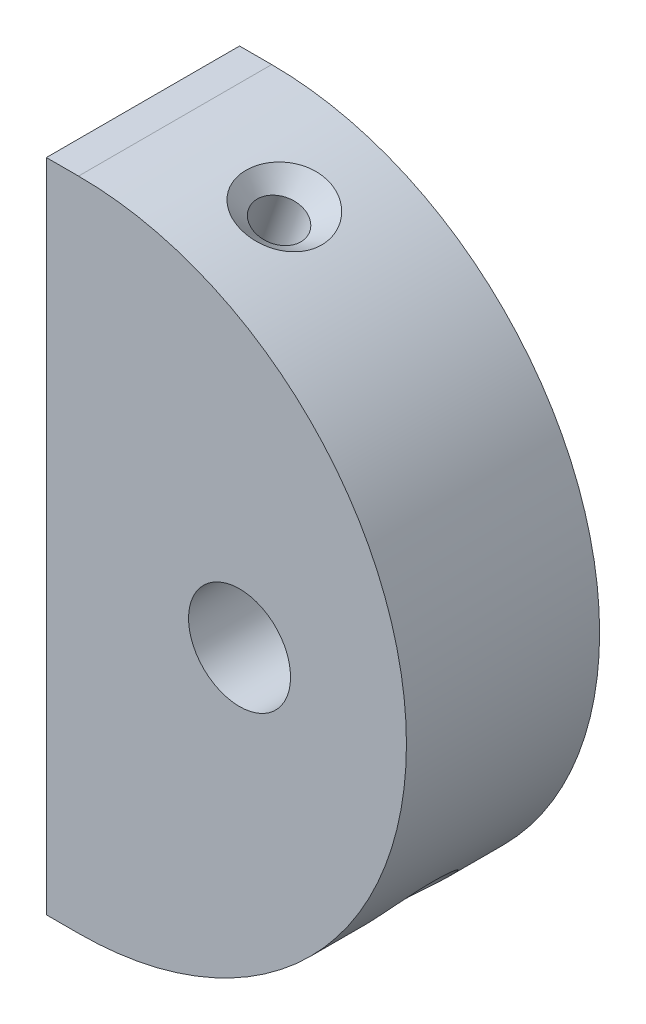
ISO-10303-21;
HEADER;
FILE_DESCRIPTION(('STEP AP214'),'2;1');
FILE_NAME('part.step','',(''),(''),'','','');
FILE_SCHEMA(('AUTOMOTIVE_DESIGN { 1 0 10303 214 1 1 1 1 }'));
ENDSEC;
DATA;
#1=APPLICATION_CONTEXT('core data for automotive mechanical design processes');
#2=APPLICATION_PROTOCOL_DEFINITION('international standard','automotive_design',2000,#1);
#3=PRODUCT_CONTEXT('',#1,'mechanical');
#4=PRODUCT('Part','Part','',(#3));
#5=PRODUCT_RELATED_PRODUCT_CATEGORY('part','',(#4));
#6=PRODUCT_DEFINITION_FORMATION('','',#4);
#7=PRODUCT_DEFINITION_CONTEXT('part definition',#1,'design');
#8=PRODUCT_DEFINITION('design','',#6,#7);
#9=PRODUCT_DEFINITION_SHAPE('','',#8);
#10=(LENGTH_UNIT() NAMED_UNIT(*) SI_UNIT(.MILLI.,.METRE.));
#11=(NAMED_UNIT(*) PLANE_ANGLE_UNIT() SI_UNIT($,.RADIAN.));
#12=(NAMED_UNIT(*) SI_UNIT($,.STERADIAN.) SOLID_ANGLE_UNIT());
#13=UNCERTAINTY_MEASURE_WITH_UNIT(LENGTH_MEASURE(1.E-05),#10,'distance_accuracy_value','');
#14=(GEOMETRIC_REPRESENTATION_CONTEXT(3) GLOBAL_UNCERTAINTY_ASSIGNED_CONTEXT((#13)) GLOBAL_UNIT_ASSIGNED_CONTEXT((#10,
#11,#12)) REPRESENTATION_CONTEXT('',''));
#15=CARTESIAN_POINT('',(0.,0.,0.));
#16=DIRECTION('',(0.,0.,1.));
#17=DIRECTION('',(1.,0.,0.));
#18=AXIS2_PLACEMENT_3D('',#15,#16,#17);
#19=CARTESIAN_POINT('',(2.64161251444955,0.,7.9375));
#20=DIRECTION('',(0.,0.,-1.));
#21=DIRECTION('',(-1.,0.,0.));
#22=AXIS2_PLACEMENT_3D('',#19,#20,#21);
#23=PLANE('',#22);
#24=CARTESIAN_POINT('',(2.64161251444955,0.,7.9375));
#25=DIRECTION('',(0.,0.,-1.));
#26=DIRECTION('',(-1.,0.,0.));
#27=AXIS2_PLACEMENT_3D('',#24,#25,#26);
#28=CIRCLE('',#27,26.9493874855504);
#29=CARTESIAN_POINT('',(2.64161251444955,26.9493874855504,7.9375));
#30=VERTEX_POINT('',#29);
#31=CARTESIAN_POINT('',(2.64161251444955,-26.9493874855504,7.9375));
#32=VERTEX_POINT('',#31);
#33=EDGE_CURVE('E124',#30,#32,#28,.T.);
#34=ORIENTED_EDGE('',*,*,#33,.F.);
#35=DIRECTION('',(1.,0.,0.));
#36=VECTOR('',#35,1.);
#37=CARTESIAN_POINT('',(0.,26.9493874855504,7.9375));
#38=LINE('',#37,#36);
#39=CARTESIAN_POINT('',(0.,26.9493874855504,7.9375));
#40=VERTEX_POINT('',#39);
#41=EDGE_CURVE('E131',#40,#30,#38,.T.);
#42=ORIENTED_EDGE('',*,*,#41,.F.);
#43=DIRECTION('',(0.,-1.,0.));
#44=VECTOR('',#43,1.);
#45=CARTESIAN_POINT('',(0.,26.9493874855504,7.9375));
#46=LINE('',#45,#44);
#47=CARTESIAN_POINT('',(0.,-26.9493874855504,7.9375));
#48=VERTEX_POINT('',#47);
#49=EDGE_CURVE('E129',#40,#48,#46,.T.);
#50=ORIENTED_EDGE('',*,*,#49,.T.);
#51=DIRECTION('',(1.,0.,0.));
#52=VECTOR('',#51,1.);
#53=CARTESIAN_POINT('',(0.,-26.9493874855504,7.9375));
#54=LINE('',#53,#52);
#55=EDGE_CURVE('E127',#48,#32,#54,.T.);
#56=ORIENTED_EDGE('',*,*,#55,.T.);
#57=EDGE_LOOP('',(#34,#42,#50,#56));
#58=FACE_BOUND('',#57,.T.);
#59=CARTESIAN_POINT('',(15.875,0.,7.9375));
#60=DIRECTION('',(0.,0.,1.));
#61=DIRECTION('',(1.,0.,0.));
#62=AXIS2_PLACEMENT_3D('',#59,#60,#61);
#63=CIRCLE('',#62,4.191);
#64=CARTESIAN_POINT('',(20.066,0.,7.9375));
#65=VERTEX_POINT('',#64);
#66=EDGE_CURVE('E110',#65,#65,#63,.T.);
#67=ORIENTED_EDGE('',*,*,#66,.F.);
#68=EDGE_LOOP('',(#67));
#69=FACE_BOUND('',#68,.T.);
#70=ADVANCED_FACE('F28',(#58,#69),#23,.F.);
#71=CARTESIAN_POINT('',(2.64161251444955,0.,-7.9375));
#72=DIRECTION('',(0.,0.,-1.));
#73=DIRECTION('',(-1.,0.,0.));
#74=AXIS2_PLACEMENT_3D('',#71,#72,#73);
#75=PLANE('',#74);
#76=CARTESIAN_POINT('',(2.64161251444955,0.,-7.9375));
#77=DIRECTION('',(0.,0.,-1.));
#78=DIRECTION('',(-1.,0.,0.));
#79=AXIS2_PLACEMENT_3D('',#76,#77,#78);
#80=CIRCLE('',#79,26.9493874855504);
#81=CARTESIAN_POINT('',(2.64161251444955,26.9493874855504,-7.9375));
#82=VERTEX_POINT('',#81);
#83=CARTESIAN_POINT('',(2.64161251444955,-26.9493874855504,-7.9375));
#84=VERTEX_POINT('',#83);
#85=EDGE_CURVE('E113',#82,#84,#80,.T.);
#86=ORIENTED_EDGE('',*,*,#85,.T.);
#87=DIRECTION('',(1.,0.,0.));
#88=VECTOR('',#87,1.);
#89=CARTESIAN_POINT('',(0.,-26.9493874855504,-7.9375));
#90=LINE('',#89,#88);
#91=CARTESIAN_POINT('',(0.,-26.9493874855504,-7.9375));
#92=VERTEX_POINT('',#91);
#93=EDGE_CURVE('E116',#92,#84,#90,.T.);
#94=ORIENTED_EDGE('',*,*,#93,.F.);
#95=DIRECTION('',(0.,-1.,0.));
#96=VECTOR('',#95,1.);
#97=CARTESIAN_POINT('',(0.,26.9493874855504,-7.9375));
#98=LINE('',#97,#96);
#99=CARTESIAN_POINT('',(0.,26.9493874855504,-7.9375));
#100=VERTEX_POINT('',#99);
#101=EDGE_CURVE('E119',#100,#92,#98,.T.);
#102=ORIENTED_EDGE('',*,*,#101,.F.);
#103=DIRECTION('',(1.,0.,0.));
#104=VECTOR('',#103,1.);
#105=CARTESIAN_POINT('',(0.,26.9493874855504,-7.9375));
#106=LINE('',#105,#104);
#107=EDGE_CURVE('E121',#100,#82,#106,.T.);
#108=ORIENTED_EDGE('',*,*,#107,.T.);
#109=EDGE_LOOP('',(#86,#94,#102,#108));
#110=FACE_BOUND('',#109,.T.);
#111=CARTESIAN_POINT('',(15.875,0.,-7.9375));
#112=DIRECTION('',(0.,0.,1.));
#113=DIRECTION('',(1.,0.,0.));
#114=AXIS2_PLACEMENT_3D('',#111,#112,#113);
#115=CIRCLE('',#114,4.191);
#116=CARTESIAN_POINT('',(20.066,0.,-7.9375));
#117=VERTEX_POINT('',#116);
#118=EDGE_CURVE('E107',#117,#117,#115,.T.);
#119=ORIENTED_EDGE('',*,*,#118,.T.);
#120=EDGE_LOOP('',(#119));
#121=FACE_BOUND('',#120,.T.);
#122=ADVANCED_FACE('F158',(#110,#121),#75,.T.);
#123=CARTESIAN_POINT('',(2.64161251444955,0.,7.9375));
#124=DIRECTION('',(0.,0.,-1.));
#125=DIRECTION('',(-1.,0.,0.));
#126=AXIS2_PLACEMENT_3D('',#123,#124,#125);
#127=CYLINDRICAL_SURFACE('',#126,26.9493874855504);
#128=CARTESIAN_POINT('',(9.7979718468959,25.9818399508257,-2.86663322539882));
#129=CARTESIAN_POINT('',(9.67203500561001,26.016527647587,-2.76504370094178));
#130=CARTESIAN_POINT('',(9.55308158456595,26.0483043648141,-2.65373042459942));
#131=CARTESIAN_POINT('',(9.33139317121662,26.1061196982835,-2.41456822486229));
#132=CARTESIAN_POINT('',(9.22867501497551,26.1321523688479,-2.28670238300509));
#133=CARTESIAN_POINT('',(9.02563814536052,26.1825595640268,-1.99493173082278));
#134=CARTESIAN_POINT('',(8.92857905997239,26.2059327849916,-1.82857341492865));
#135=CARTESIAN_POINT('',(8.76114552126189,26.2455372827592,-1.48214829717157));
#136=CARTESIAN_POINT('',(8.69078128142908,26.2617658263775,-1.30207628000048));
#137=CARTESIAN_POINT('',(8.5750079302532,26.2881734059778,-0.922513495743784));
#138=CARTESIAN_POINT('',(8.5312186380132,26.2979623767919,-0.722500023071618));
#139=CARTESIAN_POINT('',(8.47596753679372,26.310275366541,-0.31783850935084));
#140=CARTESIAN_POINT('',(8.46451065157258,26.3127982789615,-0.113189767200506));
#141=CARTESIAN_POINT('',(8.47432643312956,26.3106247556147,0.301459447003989));
#142=CARTESIAN_POINT('',(8.49659195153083,26.3057093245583,0.51143615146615));
#143=CARTESIAN_POINT('',(8.57519688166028,26.2880898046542,0.924607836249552));
#144=CARTESIAN_POINT('',(8.63153952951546,26.2753849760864,1.1278021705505));
#145=CARTESIAN_POINT('',(8.77689096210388,26.2418249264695,1.52115763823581));
#146=CARTESIAN_POINT('',(8.8658553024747,26.2209807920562,1.7113360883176));
#147=CARTESIAN_POINT('',(9.07431847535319,26.1706176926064,2.07293901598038));
#148=CARTESIAN_POINT('',(9.19381399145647,26.1410996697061,2.24436552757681));
#149=CARTESIAN_POINT('',(9.45552466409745,26.0740798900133,2.55680528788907));
#150=CARTESIAN_POINT('',(9.59679811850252,26.036893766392,2.69867308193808));
#151=CARTESIAN_POINT('',(9.90095926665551,25.9537305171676,2.953818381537));
#152=CARTESIAN_POINT('',(10.0638369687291,25.9077574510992,3.06710903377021));
#153=CARTESIAN_POINT('',(10.3945796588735,25.8106304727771,3.25360802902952));
#154=CARTESIAN_POINT('',(10.5613782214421,25.7600305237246,3.32899436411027));
#155=CARTESIAN_POINT('',(10.9041088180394,25.6521503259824,3.44714631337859));
#156=CARTESIAN_POINT('',(11.0800360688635,25.5948735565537,3.48992883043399));
#157=CARTESIAN_POINT('',(11.4228611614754,25.479200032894,3.53907248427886));
#158=CARTESIAN_POINT('',(11.5895494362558,25.4211502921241,3.5477329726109));
#159=CARTESIAN_POINT('',(11.9206628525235,25.302166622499,3.53461951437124));
#160=CARTESIAN_POINT('',(12.0850884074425,25.2412332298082,3.51285120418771));
#161=CARTESIAN_POINT('',(12.4027039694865,25.1200867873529,3.44079885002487));
#162=CARTESIAN_POINT('',(12.5560746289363,25.0598959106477,3.39126742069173));
#163=CARTESIAN_POINT('',(12.8522765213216,24.9406765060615,3.2662029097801));
#164=CARTESIAN_POINT('',(12.9951066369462,24.8816481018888,3.19066707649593));
#165=CARTESIAN_POINT('',(13.2713653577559,24.7649158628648,3.01352664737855));
#166=CARTESIAN_POINT('',(13.4043576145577,24.7073119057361,2.9111776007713));
#167=CARTESIAN_POINT('',(13.6532016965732,24.5974171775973,2.68506450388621));
#168=CARTESIAN_POINT('',(13.7690488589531,24.5451278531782,2.56129464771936));
#169=CARTESIAN_POINT('',(13.9887464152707,24.4443781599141,2.2871323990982));
#170=CARTESIAN_POINT('',(14.0912954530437,24.3964002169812,2.13552020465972));
#171=CARTESIAN_POINT('',(14.2731504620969,24.3102234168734,1.8164192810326));
#172=CARTESIAN_POINT('',(14.3524493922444,24.2720275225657,1.64892576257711));
#173=CARTESIAN_POINT('',(14.4911229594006,24.2046473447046,1.29103160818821));
#174=CARTESIAN_POINT('',(14.5488499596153,24.1762182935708,1.09984907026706));
#175=CARTESIAN_POINT('',(14.6358575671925,24.1331708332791,0.709614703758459));
#176=CARTESIAN_POINT('',(14.6651317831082,24.1185555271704,0.510561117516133));
#177=CARTESIAN_POINT('',(14.6954264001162,24.1034308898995,0.101722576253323));
#178=CARTESIAN_POINT('',(14.6952671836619,24.1035104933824,-0.108172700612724));
#179=CARTESIAN_POINT('',(14.6637304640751,24.1192550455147,-0.525034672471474));
#180=CARTESIAN_POINT('',(14.6323492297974,24.1349218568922,-0.732001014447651));
#181=CARTESIAN_POINT('',(14.5384059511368,24.1813678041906,-1.13892373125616));
#182=CARTESIAN_POINT('',(14.4755749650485,24.2122772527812,-1.33880343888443));
#183=CARTESIAN_POINT('',(14.3195610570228,24.2879081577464,-1.72359322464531));
#184=CARTESIAN_POINT('',(14.2263787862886,24.3326293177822,-1.90850362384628));
#185=CARTESIAN_POINT('',(14.0138200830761,24.4326791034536,-2.25311270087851));
#186=CARTESIAN_POINT('',(13.8951136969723,24.4877324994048,-2.4133033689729));
#187=CARTESIAN_POINT('',(13.6326128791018,24.6066673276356,-2.70781212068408));
#188=CARTESIAN_POINT('',(13.4888271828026,24.6705456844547,-2.84213917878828));
#189=CARTESIAN_POINT('',(13.1886510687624,24.8002939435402,-3.07242040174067));
#190=CARTESIAN_POINT('',(13.0334851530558,24.8658303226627,-3.17015586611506));
#191=CARTESIAN_POINT('',(12.7080406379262,24.9993466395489,-3.33351148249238));
#192=CARTESIAN_POINT('',(12.5377709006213,25.0673251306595,-3.3991503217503));
#193=CARTESIAN_POINT('',(12.2002642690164,25.1978565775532,-3.49164757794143));
#194=CARTESIAN_POINT('',(12.0337202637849,25.2604419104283,-3.52099640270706));
#195=CARTESIAN_POINT('',(11.6971409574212,25.3830439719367,-3.54810683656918));
#196=CARTESIAN_POINT('',(11.5271062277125,25.4430611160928,-3.54587357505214));
#197=CARTESIAN_POINT('',(11.1962227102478,25.5561621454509,-3.51072320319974));
#198=CARTESIAN_POINT('',(11.0352940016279,25.6094334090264,-3.47913347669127));
#199=CARTESIAN_POINT('',(10.7197482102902,25.710710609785,-3.38847000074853));
#200=CARTESIAN_POINT('',(10.5651271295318,25.7587199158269,-3.32941396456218));
#201=CARTESIAN_POINT('',(10.306302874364,25.8367013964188,-3.20534009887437));
#202=CARTESIAN_POINT('',(10.1996747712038,25.8680636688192,-3.14614026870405));
#203=CARTESIAN_POINT('',(9.99334619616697,25.9274566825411,-3.01537309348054));
#204=CARTESIAN_POINT('',(9.89364389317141,25.9554883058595,-2.94380903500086));
#205=CARTESIAN_POINT('',(9.7979718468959,25.9818399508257,-2.86663322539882));
#206=B_SPLINE_CURVE_WITH_KNOTS('',3,(#128,#129,#130,#131,#132,#133,#134,#135,#136,#137,#138,
#139,#140,#141,#142,#143,#144,#145,#146,#147,#148,#149,#150,#151,#152,#153,#154,#155,#156,#157,
#158,#159,#160,#161,#162,#163,#164,#165,#166,#167,#168,#169,#170,#171,#172,#173,#174,#175,#176,
#177,#178,#179,#180,#181,#182,#183,#184,#185,#186,#187,#188,#189,#190,#191,#192,#193,#194,#195,
#196,#197,#198,#199,#200,#201,#202,#203,#204,#205),.UNSPECIFIED.,.T.,.F.,(4,2,2,2,2,2,2,2,2,2,2,
2,2,2,2,2,2,2,2,2,2,2,2,2,2,2,2,2,2,2,2,2,2,2,2,2,2,2,4),(0.,0.496088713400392,
0.992688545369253,1.57214224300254,2.15181741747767,2.76398387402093,3.37624354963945,
4.00688299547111,4.63758233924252,5.26742558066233,5.89720043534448,6.50493048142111,
7.11238043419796,7.67910588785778,8.24553733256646,8.77307120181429,9.30050736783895,
9.81429263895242,10.3281322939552,10.8581153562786,11.3882422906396,11.9534534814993,
12.5188356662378,13.1212948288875,13.7238892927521,14.3506392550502,14.9774641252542,
15.6097432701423,16.2420088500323,16.8593536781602,17.4764839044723,18.0576157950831,
18.6384089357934,19.1766205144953,19.7147446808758,20.2296624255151,20.7442485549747,
21.1212186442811,21.4980886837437),.UNSPECIFIED.);
#207=CARTESIAN_POINT('',(11.6476930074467,25.4,3.5433));
#208=VERTEX_POINT('',#207);
#209=CARTESIAN_POINT('',(11.6476930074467,25.4,-3.5433));
#210=VERTEX_POINT('',#209);
#211=EDGE_CURVE('E11',#208,#210,#206,.T.);
#212=ORIENTED_EDGE('',*,*,#211,.F.);
#213=EDGE_CURVE('E33',#210,#208,#206,.T.);
#214=ORIENTED_EDGE('',*,*,#213,.F.);
#215=EDGE_LOOP('',(#212,#214));
#216=FACE_BOUND('',#215,.T.);
#217=CARTESIAN_POINT('',(20.1425282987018,-20.4935949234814,-2.70960994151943));
#218=CARTESIAN_POINT('',(20.2356817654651,-20.4140439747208,-2.81999497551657));
#219=CARTESIAN_POINT('',(20.3344098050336,-20.3286325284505,-2.92146354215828));
#220=CARTESIAN_POINT('',(20.5408104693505,-20.1471357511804,-3.10379113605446));
#221=CARTESIAN_POINT('',(20.6484856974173,-20.0510473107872,-3.18464413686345));
#222=CARTESIAN_POINT('',(20.8837178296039,-19.8374199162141,-3.33162138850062));
#223=CARTESIAN_POINT('',(21.0120966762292,-19.7186944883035,-3.39474002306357));
#224=CARTESIAN_POINT('',(21.2725338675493,-19.4728088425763,-3.48889539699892));
#225=CARTESIAN_POINT('',(21.4045920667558,-19.3456489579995,-3.51993340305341));
#226=CARTESIAN_POINT('',(21.6603273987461,-19.0941951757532,-3.54764166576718));
#227=CARTESIAN_POINT('',(21.7840523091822,-18.9701526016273,-3.54617412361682));
#228=CARTESIAN_POINT('',(22.0270949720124,-18.7217185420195,-3.51349194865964));
#229=CARTESIAN_POINT('',(22.146413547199,-18.5973271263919,-3.48228289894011));
#230=CARTESIAN_POINT('',(22.3755940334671,-18.3539366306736,-3.39219230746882));
#231=CARTESIAN_POINT('',(22.4855769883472,-18.234883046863,-3.33376295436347));
#232=CARTESIAN_POINT('',(22.6957795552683,-18.0034536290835,-3.19164558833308));
#233=CARTESIAN_POINT('',(22.7959976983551,-17.8910788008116,-3.1079537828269));
#234=CARTESIAN_POINT('',(22.988604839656,-17.6717725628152,-2.91443295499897));
#235=CARTESIAN_POINT('',(23.0805308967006,-17.5652290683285,-2.80370541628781));
#236=CARTESIAN_POINT('',(23.2505807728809,-17.3654014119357,-2.56163575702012));
#237=CARTESIAN_POINT('',(23.3287006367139,-17.2721210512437,-2.43028774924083));
#238=CARTESIAN_POINT('',(23.4751484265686,-17.0952440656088,-2.14110062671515));
#239=CARTESIAN_POINT('',(23.5424396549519,-17.0127478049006,-1.98206344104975));
#240=CARTESIAN_POINT('',(23.6597107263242,-16.8676542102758,-1.64922344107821));
#241=CARTESIAN_POINT('',(23.7096854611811,-16.8050627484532,-1.47541628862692));
#242=CARTESIAN_POINT('',(23.7945713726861,-16.6981078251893,-1.10630293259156));
#243=CARTESIAN_POINT('',(23.8283441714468,-16.6551301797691,-0.910331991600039));
#244=CARTESIAN_POINT('',(23.8757723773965,-16.5946202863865,-0.512121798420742));
#245=CARTESIAN_POINT('',(23.889423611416,-16.577093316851,-0.30988125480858));
#246=CARTESIAN_POINT('',(23.8966579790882,-16.5678177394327,0.102651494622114));
#247=CARTESIAN_POINT('',(23.8895229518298,-16.5769916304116,0.312978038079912));
#248=CARTESIAN_POINT('',(23.8536532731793,-16.6228651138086,0.728757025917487));
#249=CARTESIAN_POINT('',(23.8249163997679,-16.6595675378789,0.934208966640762));
#250=CARTESIAN_POINT('',(23.7458605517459,-16.7596020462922,1.3350419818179));
#251=CARTESIAN_POINT('',(23.695463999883,-16.8230298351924,1.53038400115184));
#252=CARTESIAN_POINT('',(23.5734344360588,-16.9746205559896,1.90415797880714));
#253=CARTESIAN_POINT('',(23.5018027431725,-17.0627819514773,2.08259098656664));
#254=CARTESIAN_POINT('',(23.340444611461,-17.2581391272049,2.41152780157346));
#255=CARTESIAN_POINT('',(23.2513107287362,-17.3647005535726,2.56269744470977));
#256=CARTESIAN_POINT('',(23.0549669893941,-17.5950919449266,2.8377135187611));
#257=CARTESIAN_POINT('',(22.9477645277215,-17.7189148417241,2.96157108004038));
#258=CARTESIAN_POINT('',(22.7246984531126,-17.971245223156,3.16985094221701));
#259=CARTESIAN_POINT('',(22.6098080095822,-18.0989642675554,3.25626825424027));
#260=CARTESIAN_POINT('',(22.3687516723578,-18.3614025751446,3.39663898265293));
#261=CARTESIAN_POINT('',(22.2425919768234,-18.496117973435,3.45061011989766));
#262=CARTESIAN_POINT('',(21.9920277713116,-18.7579686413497,3.52088130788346));
#263=CARTESIAN_POINT('',(21.8681440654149,-18.884956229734,3.53960138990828));
#264=CARTESIAN_POINT('',(21.6174793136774,-19.1368099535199,3.54600221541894));
#265=CARTESIAN_POINT('',(21.4906989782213,-19.2616765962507,3.53369049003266));
#266=CARTESIAN_POINT('',(21.2426013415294,-19.5013191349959,3.47956447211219));
#267=CARTESIAN_POINT('',(21.1212474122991,-19.6162949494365,3.43879132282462));
#268=CARTESIAN_POINT('',(20.8830446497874,-19.8379973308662,3.33051995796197));
#269=CARTESIAN_POINT('',(20.766196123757,-19.9447233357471,3.26301992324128));
#270=CARTESIAN_POINT('',(20.5376479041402,-20.1500763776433,3.10193278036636));
#271=CARTESIAN_POINT('',(20.4261295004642,-20.2484593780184,3.00777907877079));
#272=CARTESIAN_POINT('',(20.214211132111,-20.432645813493,2.79730376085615));
#273=CARTESIAN_POINT('',(20.1138139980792,-20.5184460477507,2.68097652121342));
#274=CARTESIAN_POINT('',(19.9207366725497,-20.6813521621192,2.42168844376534));
#275=CARTESIAN_POINT('',(19.8289411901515,-20.7575696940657,2.27751135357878));
#276=CARTESIAN_POINT('',(19.6631200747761,-20.8937624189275,1.97226941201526));
#277=CARTESIAN_POINT('',(19.5890999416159,-20.9537325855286,1.81119935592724));
#278=CARTESIAN_POINT('',(19.4562957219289,-21.0604770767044,1.46502101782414));
#279=CARTESIAN_POINT('',(19.3988858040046,-21.1060802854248,1.27902327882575));
#280=CARTESIAN_POINT('',(19.3079716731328,-21.1779443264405,0.897686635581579));
#281=CARTESIAN_POINT('',(19.2744726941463,-21.2042009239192,0.702345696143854));
#282=CARTESIAN_POINT('',(19.2313333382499,-21.2379721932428,0.298492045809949));
#283=CARTESIAN_POINT('',(19.2228316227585,-21.2445925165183,0.0897817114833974));
#284=CARTESIAN_POINT('',(19.2331719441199,-21.236517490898,-0.326593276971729));
#285=CARTESIAN_POINT('',(19.2520211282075,-21.2218165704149,-0.534257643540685));
#286=CARTESIAN_POINT('',(19.3169735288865,-21.1708182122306,-0.945573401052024));
#287=CARTESIAN_POINT('',(19.3634511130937,-21.1342240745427,-1.14912918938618));
#288=CARTESIAN_POINT('',(19.4825727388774,-21.0394226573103,-1.54308839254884));
#289=CARTESIAN_POINT('',(19.5552018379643,-20.981227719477,-1.7334992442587));
#290=CARTESIAN_POINT('',(19.7087926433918,-20.8563830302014,-2.0618846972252));
#291=CARTESIAN_POINT('',(19.7857851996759,-20.7932396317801,-2.20307251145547));
#292=CARTESIAN_POINT('',(19.9540064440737,-20.6533882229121,-2.46927967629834));
#293=CARTESIAN_POINT('',(20.0452262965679,-20.5766886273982,-2.59430897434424));
#294=CARTESIAN_POINT('',(20.1425282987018,-20.4935949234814,-2.70960994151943));
#295=B_SPLINE_CURVE_WITH_KNOTS('',3,(#217,#218,#219,#220,#221,#222,#223,#224,#225,#226,#227,
#228,#229,#230,#231,#232,#233,#234,#235,#236,#237,#238,#239,#240,#241,#242,#243,#244,#245,#246,
#247,#248,#249,#250,#251,#252,#253,#254,#255,#256,#257,#258,#259,#260,#261,#262,#263,#264,#265,
#266,#267,#268,#269,#270,#271,#272,#273,#274,#275,#276,#277,#278,#279,#280,#281,#282,#283,#284,
#285,#286,#287,#288,#289,#290,#291,#292,#293,#294),.UNSPECIFIED.,.T.,.F.,(4,2,2,2,2,2,2,2,2,2,2,
2,2,2,2,2,2,2,2,2,2,2,2,2,2,2,2,2,2,2,2,2,2,2,2,2,2,2,4),(0.,0.494223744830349,
0.988591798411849,1.54334866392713,2.09808362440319,2.62112523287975,3.14406867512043,
3.65861877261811,4.17324615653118,4.70811378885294,5.24313440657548,5.81478806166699,
6.38661020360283,6.99421661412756,7.60194902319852,8.2309247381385,8.85996515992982,
9.49127760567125,10.1225508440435,10.7353027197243,11.3478044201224,11.9216624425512,
12.4952067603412,13.0276954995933,13.5600550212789,14.0738964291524,14.5877728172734,
15.1135197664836,15.6394002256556,16.1984128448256,16.7575982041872,17.3547163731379,
17.9519652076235,18.5760277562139,19.2002534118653,19.833136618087,20.4656587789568,
20.9822120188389,21.4984457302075),.UNSPECIFIED.);
#296=CARTESIAN_POINT('',(21.7037998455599,-19.05,-3.5433));
#297=VERTEX_POINT('',#296);
#298=CARTESIAN_POINT('',(21.7037998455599,-19.05,3.5433));
#299=VERTEX_POINT('',#298);
#300=EDGE_CURVE('E51',#297,#299,#295,.T.);
#301=ORIENTED_EDGE('',*,*,#300,.F.);
#302=EDGE_CURVE('E137',#299,#297,#295,.T.);
#303=ORIENTED_EDGE('',*,*,#302,.F.);
#304=EDGE_LOOP('',(#301,#303));
#305=FACE_BOUND('',#304,.T.);
#306=ORIENTED_EDGE('',*,*,#85,.F.);
#307=DIRECTION('',(0.,0.,-1.));
#308=VECTOR('',#307,1.);
#309=CARTESIAN_POINT('',(2.64161251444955,26.9493874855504,7.9375));
#310=LINE('',#309,#308);
#311=EDGE_CURVE('E135',#30,#82,#310,.T.);
#312=ORIENTED_EDGE('',*,*,#311,.F.);
#313=ORIENTED_EDGE('',*,*,#33,.T.);
#314=DIRECTION('',(0.,0.,-1.));
#315=VECTOR('',#314,1.);
#316=CARTESIAN_POINT('',(2.64161251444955,-26.9493874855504,7.9375));
#317=LINE('',#316,#315);
#318=EDGE_CURVE('E134',#32,#84,#317,.T.);
#319=ORIENTED_EDGE('',*,*,#318,.T.);
#320=EDGE_LOOP('',(#306,#312,#313,#319));
#321=FACE_BOUND('',#320,.T.);
#322=ADVANCED_FACE('F30',(#216,#305,#321),#127,.T.);
#323=CARTESIAN_POINT('',(0.,26.9493874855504,7.9375));
#324=DIRECTION('',(0.,1.,0.));
#325=DIRECTION('',(0.,0.,1.));
#326=AXIS2_PLACEMENT_3D('',#323,#324,#325);
#327=PLANE('',#326);
#328=ORIENTED_EDGE('',*,*,#107,.F.);
#329=DIRECTION('',(0.,0.,-1.));
#330=VECTOR('',#329,1.);
#331=CARTESIAN_POINT('',(0.,26.9493874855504,7.9375));
#332=LINE('',#331,#330);
#333=EDGE_CURVE('E138',#40,#100,#332,.T.);
#334=ORIENTED_EDGE('',*,*,#333,.F.);
#335=ORIENTED_EDGE('',*,*,#41,.T.);
#336=ORIENTED_EDGE('',*,*,#311,.T.);
#337=EDGE_LOOP('',(#328,#334,#335,#336));
#338=FACE_BOUND('',#337,.T.);
#339=ADVANCED_FACE('F165',(#338),#327,.T.);
#340=CARTESIAN_POINT('',(0.,26.9493874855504,7.9375));
#341=DIRECTION('',(1.,0.,0.));
#342=DIRECTION('',(0.,0.,-1.));
#343=AXIS2_PLACEMENT_3D('',#340,#341,#342);
#344=PLANE('',#343);
#345=ORIENTED_EDGE('',*,*,#101,.T.);
#346=DIRECTION('',(0.,0.,-1.));
#347=VECTOR('',#346,1.);
#348=CARTESIAN_POINT('',(0.,-26.9493874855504,7.9375));
#349=LINE('',#348,#347);
#350=EDGE_CURVE('E140',#48,#92,#349,.T.);
#351=ORIENTED_EDGE('',*,*,#350,.F.);
#352=ORIENTED_EDGE('',*,*,#49,.F.);
#353=ORIENTED_EDGE('',*,*,#333,.T.);
#354=EDGE_LOOP('',(#345,#351,#352,#353));
#355=FACE_BOUND('',#354,.T.);
#356=ADVANCED_FACE('F168',(#355),#344,.F.);
#357=CARTESIAN_POINT('',(0.,-26.9493874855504,7.9375));
#358=DIRECTION('',(0.,1.,0.));
#359=DIRECTION('',(0.,0.,1.));
#360=AXIS2_PLACEMENT_3D('',#357,#358,#359);
#361=PLANE('',#360);
#362=ORIENTED_EDGE('',*,*,#93,.T.);
#363=ORIENTED_EDGE('',*,*,#318,.F.);
#364=ORIENTED_EDGE('',*,*,#55,.F.);
#365=ORIENTED_EDGE('',*,*,#350,.T.);
#366=EDGE_LOOP('',(#362,#363,#364,#365));
#367=FACE_BOUND('',#366,.T.);
#368=ADVANCED_FACE('F156',(#367),#361,.F.);
#369=CARTESIAN_POINT('',(15.875,0.,7.9375));
#370=DIRECTION('',(0.,0.,-1.));
#371=DIRECTION('',(-1.,0.,0.));
#372=AXIS2_PLACEMENT_3D('',#369,#370,#371);
#373=CYLINDRICAL_SURFACE('',#372,4.191);
#374=ORIENTED_EDGE('',*,*,#66,.T.);
#375=EDGE_LOOP('',(#374));
#376=FACE_BOUND('',#375,.T.);
#377=ORIENTED_EDGE('',*,*,#118,.F.);
#378=EDGE_LOOP('',(#377));
#379=FACE_BOUND('',#378,.T.);
#380=ADVANCED_FACE('F152',(#376,#379),#373,.F.);
#381=CARTESIAN_POINT('',(21.7037998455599,-19.05,0.));
#382=DIRECTION('',(0.707332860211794,-0.706880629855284,0.));
#383=DIRECTION('',(0.706880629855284,0.707332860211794,0.));
#384=AXIS2_PLACEMENT_3D('',#381,#382,#383);
#385=CONICAL_SURFACE('',#384,3.5433,0.872664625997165);
#386=ORIENTED_EDGE('',*,*,#300,.T.);
#387=ORIENTED_EDGE('',*,*,#302,.T.);
#388=EDGE_LOOP('',(#386,#387));
#389=FACE_BOUND('',#388,.T.);
#390=CARTESIAN_POINT('',(20.7276626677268,-18.0744869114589,0.));
#391=DIRECTION('',(0.707332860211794,-0.706880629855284,0.));
#392=DIRECTION('',(0.706880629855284,0.707332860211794,0.));
#393=AXIS2_PLACEMENT_3D('',#390,#391,#392);
#394=CIRCLE('',#393,1.89864999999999);
#395=CARTESIAN_POINT('',(22.0697815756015,-16.7315093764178,0.));
#396=VERTEX_POINT('',#395);
#397=EDGE_CURVE('E104',#396,#396,#394,.T.);
#398=ORIENTED_EDGE('',*,*,#397,.F.);
#399=EDGE_LOOP('',(#398));
#400=FACE_BOUND('',#399,.T.);
#401=ADVANCED_FACE('F146',(#389,#400),#385,.F.);
#402=CARTESIAN_POINT('',(21.7037998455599,-19.05,0.));
#403=DIRECTION('',(0.707332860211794,-0.706880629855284,0.));
#404=DIRECTION('',(0.706880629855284,0.707332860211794,0.));
#405=AXIS2_PLACEMENT_3D('',#402,#403,#404);
#406=CYLINDRICAL_SURFACE('',#405,1.89864999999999);
#407=CARTESIAN_POINT('',(12.7206725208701,-10.0726160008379,0.));
#408=DIRECTION('',(0.707332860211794,-0.706880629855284,0.));
#409=DIRECTION('',(0.706880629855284,0.707332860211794,0.));
#410=AXIS2_PLACEMENT_3D('',#407,#408,#409);
#411=CIRCLE('',#410,1.89864999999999);
#412=CARTESIAN_POINT('',(14.0627914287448,-8.72963846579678,0.));
#413=VERTEX_POINT('',#412);
#414=EDGE_CURVE('E99',#413,#413,#411,.T.);
#415=ORIENTED_EDGE('',*,*,#414,.F.);
#416=EDGE_LOOP('',(#415));
#417=FACE_BOUND('',#416,.T.);
#418=ORIENTED_EDGE('',*,*,#397,.T.);
#419=EDGE_LOOP('',(#418));
#420=FACE_BOUND('',#419,.T.);
#421=ADVANCED_FACE('F151',(#417,#420),#406,.F.);
#422=CARTESIAN_POINT('',(12.7206725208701,-10.0726160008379,0.));
#423=DIRECTION('',(0.707332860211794,-0.706880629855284,0.));
#424=DIRECTION('',(0.706880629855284,0.707332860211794,0.));
#425=AXIS2_PLACEMENT_3D('',#422,#423,#424);
#426=CONICAL_SURFACE('',#425,1.89864999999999,1.02974425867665);
#427=CARTESIAN_POINT('',(11.9137302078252,-9.2661896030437,0.));
#428=VERTEX_POINT('',#427);
#429=VERTEX_LOOP('',#428);
#430=FACE_BOUND('',#429,.T.);
#431=ORIENTED_EDGE('',*,*,#414,.T.);
#432=EDGE_LOOP('',(#431));
#433=FACE_BOUND('',#432,.T.);
#434=ADVANCED_FACE('F200',(#430,#433),#426,.F.);
#435=CARTESIAN_POINT('',(11.6476930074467,25.4,0.));
#436=DIRECTION('',(0.334184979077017,0.942507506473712,0.));
#437=DIRECTION('',(-0.942507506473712,0.334184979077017,0.));
#438=AXIS2_PLACEMENT_3D('',#435,#436,#437);
#439=CONICAL_SURFACE('',#438,3.5433,0.872664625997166);
#440=ORIENTED_EDGE('',*,*,#211,.T.);
#441=ORIENTED_EDGE('',*,*,#213,.T.);
#442=EDGE_LOOP('',(#440,#441));
#443=FACE_BOUND('',#442,.T.);
#444=CARTESIAN_POINT('',(11.1865093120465,24.0993158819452,0.));
#445=DIRECTION('',(0.334184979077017,0.942507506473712,0.));
#446=DIRECTION('',(-0.942507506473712,0.334184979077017,0.));
#447=AXIS2_PLACEMENT_3D('',#444,#445,#446);
#448=CIRCLE('',#447,1.89864999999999);
#449=CARTESIAN_POINT('',(9.39701743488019,24.7338161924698,0.));
#450=VERTEX_POINT('',#449);
#451=EDGE_CURVE('E96',#450,#450,#448,.T.);
#452=ORIENTED_EDGE('',*,*,#451,.F.);
#453=EDGE_LOOP('',(#452));
#454=FACE_BOUND('',#453,.T.);
#455=ADVANCED_FACE('F197',(#443,#454),#439,.F.);
#456=CARTESIAN_POINT('',(11.6476930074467,25.4,0.));
#457=DIRECTION('',(0.334184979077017,0.942507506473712,0.));
#458=DIRECTION('',(-0.942507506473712,0.334184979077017,0.));
#459=AXIS2_PLACEMENT_3D('',#456,#457,#458);
#460=CYLINDRICAL_SURFACE('',#459,1.89864999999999);
#461=CARTESIAN_POINT('',(7.40354377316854,13.4301546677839,0.));
#462=DIRECTION('',(0.334184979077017,0.942507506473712,0.));
#463=DIRECTION('',(-0.942507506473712,0.334184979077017,0.));
#464=AXIS2_PLACEMENT_3D('',#461,#462,#463);
#465=CIRCLE('',#464,1.89864999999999);
#466=CARTESIAN_POINT('',(5.61405189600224,14.0646549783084,0.));
#467=VERTEX_POINT('',#466);
#468=EDGE_CURVE('E94',#467,#467,#465,.T.);
#469=ORIENTED_EDGE('',*,*,#468,.F.);
#470=EDGE_LOOP('',(#469));
#471=FACE_BOUND('',#470,.T.);
#472=ORIENTED_EDGE('',*,*,#451,.T.);
#473=EDGE_LOOP('',(#472));
#474=FACE_BOUND('',#473,.T.);
#475=ADVANCED_FACE('F90',(#471,#474),#460,.F.);
#476=CARTESIAN_POINT('',(7.40354377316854,13.4301546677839,0.));
#477=DIRECTION('',(0.334184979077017,0.942507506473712,0.));
#478=DIRECTION('',(-0.942507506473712,0.334184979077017,0.));
#479=AXIS2_PLACEMENT_3D('',#476,#477,#478);
#480=CONICAL_SURFACE('',#479,1.89864999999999,1.02974425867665);
#481=CARTESIAN_POINT('',(7.02229752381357,12.3549194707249,0.));
#482=VERTEX_POINT('',#481);
#483=VERTEX_LOOP('',#482);
#484=FACE_BOUND('',#483,.T.);
#485=ORIENTED_EDGE('',*,*,#468,.T.);
#486=EDGE_LOOP('',(#485));
#487=FACE_BOUND('',#486,.T.);
#488=ADVANCED_FACE('F87',(#484,#487),#480,.F.);
#489=CLOSED_SHELL('',(#70,#122,#322,#339,#356,#368,#380,#401,#421,#434,#455,#475,#488));
#490=MANIFOLD_SOLID_BREP('B2',#489);
#491=ADVANCED_BREP_SHAPE_REPRESENTATION('',(#18,#490),#14);
#492=SHAPE_DEFINITION_REPRESENTATION(#9,#491);
ENDSEC;
END-ISO-10303-21;
